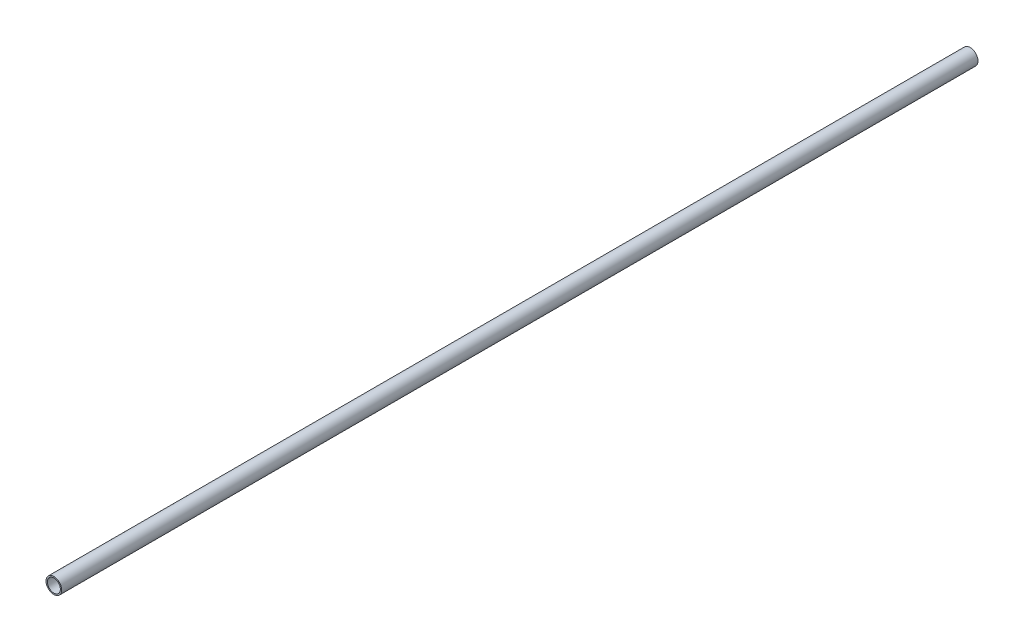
ISO-10303-21;
HEADER;
FILE_DESCRIPTION(('STEP AP214'),'2;1');
FILE_NAME('part.step','',(''),(''),'','','');
FILE_SCHEMA(('AUTOMOTIVE_DESIGN { 1 0 10303 214 1 1 1 1 }'));
ENDSEC;
DATA;
#1=APPLICATION_CONTEXT('core data for automotive mechanical design processes');
#2=APPLICATION_PROTOCOL_DEFINITION('international standard','automotive_design',2000,#1);
#3=PRODUCT_CONTEXT('',#1,'mechanical');
#4=PRODUCT('Part','Part','',(#3));
#5=PRODUCT_RELATED_PRODUCT_CATEGORY('part','',(#4));
#6=PRODUCT_DEFINITION_FORMATION('','',#4);
#7=PRODUCT_DEFINITION_CONTEXT('part definition',#1,'design');
#8=PRODUCT_DEFINITION('design','',#6,#7);
#9=PRODUCT_DEFINITION_SHAPE('','',#8);
#10=(LENGTH_UNIT() NAMED_UNIT(*) SI_UNIT(.MILLI.,.METRE.));
#11=(NAMED_UNIT(*) PLANE_ANGLE_UNIT() SI_UNIT($,.RADIAN.));
#12=(NAMED_UNIT(*) SI_UNIT($,.STERADIAN.) SOLID_ANGLE_UNIT());
#13=UNCERTAINTY_MEASURE_WITH_UNIT(LENGTH_MEASURE(1.E-05),#10,'distance_accuracy_value','');
#14=(GEOMETRIC_REPRESENTATION_CONTEXT(3) GLOBAL_UNCERTAINTY_ASSIGNED_CONTEXT((#13)) GLOBAL_UNIT_ASSIGNED_CONTEXT((#10,
#11,#12)) REPRESENTATION_CONTEXT('',''));
#15=CARTESIAN_POINT('',(0.,0.,0.));
#16=DIRECTION('',(0.,0.,1.));
#17=DIRECTION('',(1.,0.,0.));
#18=AXIS2_PLACEMENT_3D('',#15,#16,#17);
#19=CARTESIAN_POINT('',(0.,0.,2100.));
#20=DIRECTION('',(0.,0.,1.));
#21=DIRECTION('',(1.,0.,0.));
#22=AXIS2_PLACEMENT_3D('',#19,#20,#21);
#23=PLANE('',#22);
#24=CARTESIAN_POINT('',(0.,0.,2100.));
#25=DIRECTION('',(0.,0.,1.));
#26=DIRECTION('',(1.,0.,0.));
#27=AXIS2_PLACEMENT_3D('',#24,#25,#26);
#28=CIRCLE('',#27,18.);
#29=CARTESIAN_POINT('',(18.,0.,2100.));
#30=VERTEX_POINT('',#29);
#31=EDGE_CURVE('E10',#30,#30,#28,.T.);
#32=ORIENTED_EDGE('',*,*,#31,.T.);
#33=EDGE_LOOP('',(#32));
#34=FACE_BOUND('',#33,.T.);
#35=CARTESIAN_POINT('',(0.,0.,2100.));
#36=DIRECTION('',(0.,0.,1.));
#37=DIRECTION('',(1.,0.,0.));
#38=AXIS2_PLACEMENT_3D('',#35,#36,#37);
#39=CIRCLE('',#38,15.);
#40=CARTESIAN_POINT('',(15.,0.,2100.));
#41=VERTEX_POINT('',#40);
#42=EDGE_CURVE('E41',#41,#41,#39,.T.);
#43=ORIENTED_EDGE('',*,*,#42,.F.);
#44=EDGE_LOOP('',(#43));
#45=FACE_BOUND('',#44,.T.);
#46=ADVANCED_FACE('F30',(#34,#45),#23,.T.);
#47=CARTESIAN_POINT('',(0.,0.,0.));
#48=DIRECTION('',(0.,0.,1.));
#49=DIRECTION('',(1.,0.,0.));
#50=AXIS2_PLACEMENT_3D('',#47,#48,#49);
#51=PLANE('',#50);
#52=CARTESIAN_POINT('',(0.,0.,0.));
#53=DIRECTION('',(0.,0.,1.));
#54=DIRECTION('',(1.,0.,0.));
#55=AXIS2_PLACEMENT_3D('',#52,#53,#54);
#56=CIRCLE('',#55,18.);
#57=CARTESIAN_POINT('',(18.,0.,0.));
#58=VERTEX_POINT('',#57);
#59=EDGE_CURVE('E34',#58,#58,#56,.T.);
#60=ORIENTED_EDGE('',*,*,#59,.F.);
#61=EDGE_LOOP('',(#60));
#62=FACE_BOUND('',#61,.T.);
#63=CARTESIAN_POINT('',(0.,0.,0.));
#64=DIRECTION('',(0.,0.,1.));
#65=DIRECTION('',(1.,0.,0.));
#66=AXIS2_PLACEMENT_3D('',#63,#64,#65);
#67=CIRCLE('',#66,15.);
#68=CARTESIAN_POINT('',(15.,0.,0.));
#69=VERTEX_POINT('',#68);
#70=EDGE_CURVE('E43',#69,#69,#67,.T.);
#71=ORIENTED_EDGE('',*,*,#70,.T.);
#72=EDGE_LOOP('',(#71));
#73=FACE_BOUND('',#72,.T.);
#74=ADVANCED_FACE('F53',(#62,#73),#51,.F.);
#75=CARTESIAN_POINT('',(0.,0.,2100.));
#76=DIRECTION('',(0.,0.,-1.));
#77=DIRECTION('',(-1.,0.,0.));
#78=AXIS2_PLACEMENT_3D('',#75,#76,#77);
#79=CYLINDRICAL_SURFACE('',#78,18.);
#80=ORIENTED_EDGE('',*,*,#31,.F.);
#81=EDGE_LOOP('',(#80));
#82=FACE_BOUND('',#81,.T.);
#83=ORIENTED_EDGE('',*,*,#59,.T.);
#84=EDGE_LOOP('',(#83));
#85=FACE_BOUND('',#84,.T.);
#86=ADVANCED_FACE('F32',(#82,#85),#79,.T.);
#87=CARTESIAN_POINT('',(0.,0.,2100.));
#88=DIRECTION('',(0.,0.,-1.));
#89=DIRECTION('',(-1.,0.,0.));
#90=AXIS2_PLACEMENT_3D('',#87,#88,#89);
#91=CYLINDRICAL_SURFACE('',#90,15.);
#92=ORIENTED_EDGE('',*,*,#42,.T.);
#93=EDGE_LOOP('',(#92));
#94=FACE_BOUND('',#93,.T.);
#95=ORIENTED_EDGE('',*,*,#70,.F.);
#96=EDGE_LOOP('',(#95));
#97=FACE_BOUND('',#96,.T.);
#98=ADVANCED_FACE('F49',(#94,#97),#91,.F.);
#99=CLOSED_SHELL('',(#46,#74,#86,#98));
#100=MANIFOLD_SOLID_BREP('B2',#99);
#101=ADVANCED_BREP_SHAPE_REPRESENTATION('',(#18,#100),#14);
#102=SHAPE_DEFINITION_REPRESENTATION(#9,#101);
ENDSEC;
END-ISO-10303-21;
